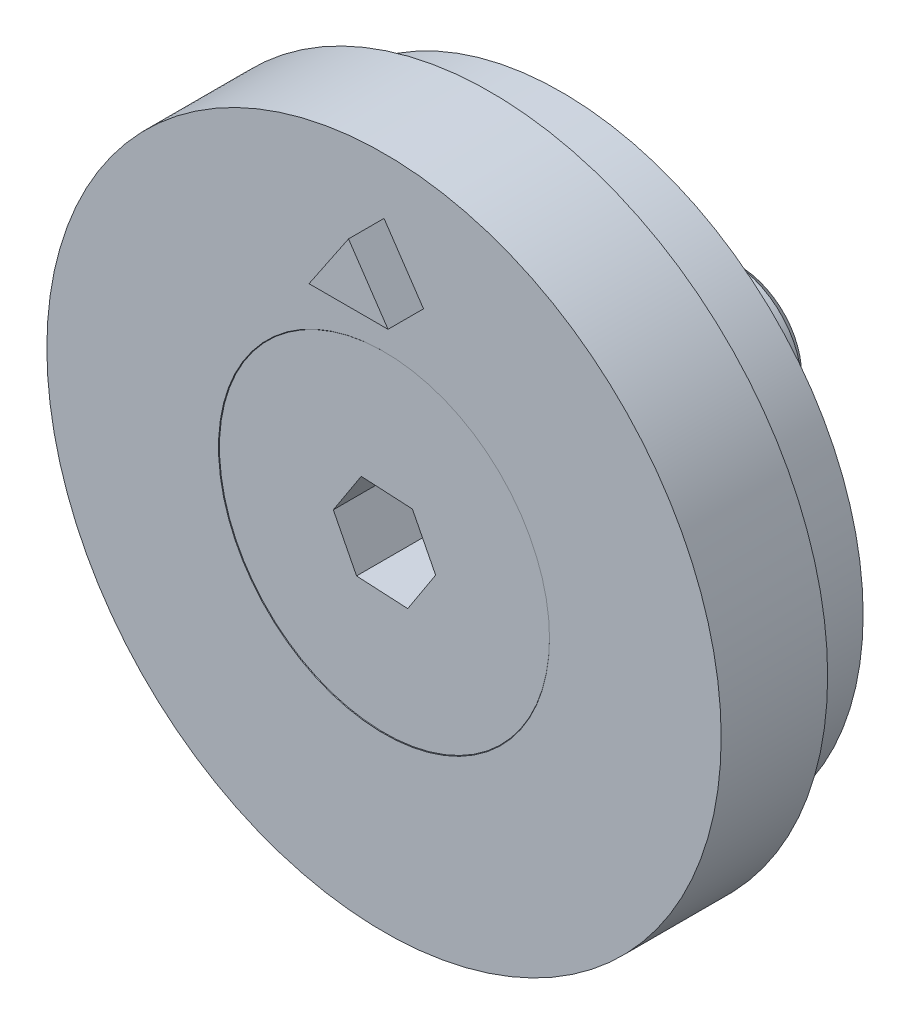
ISO-10303-21;
HEADER;
FILE_DESCRIPTION(('STEP AP214'),'2;1');
FILE_NAME('part.step','',(''),(''),'','','');
FILE_SCHEMA(('AUTOMOTIVE_DESIGN { 1 0 10303 214 1 1 1 1 }'));
ENDSEC;
DATA;
#1=APPLICATION_CONTEXT('core data for automotive mechanical design processes');
#2=APPLICATION_PROTOCOL_DEFINITION('international standard','automotive_design',2000,#1);
#3=PRODUCT_CONTEXT('',#1,'mechanical');
#4=PRODUCT('Part','Part','',(#3));
#5=PRODUCT_RELATED_PRODUCT_CATEGORY('part','',(#4));
#6=PRODUCT_DEFINITION_FORMATION('','',#4);
#7=PRODUCT_DEFINITION_CONTEXT('part definition',#1,'design');
#8=PRODUCT_DEFINITION('design','',#6,#7);
#9=PRODUCT_DEFINITION_SHAPE('','',#8);
#10=(LENGTH_UNIT() NAMED_UNIT(*) SI_UNIT(.MILLI.,.METRE.));
#11=(NAMED_UNIT(*) PLANE_ANGLE_UNIT() SI_UNIT($,.RADIAN.));
#12=(NAMED_UNIT(*) SI_UNIT($,.STERADIAN.) SOLID_ANGLE_UNIT());
#13=UNCERTAINTY_MEASURE_WITH_UNIT(LENGTH_MEASURE(1.E-05),#10,'distance_accuracy_value','');
#14=(GEOMETRIC_REPRESENTATION_CONTEXT(3) GLOBAL_UNCERTAINTY_ASSIGNED_CONTEXT((#13)) GLOBAL_UNIT_ASSIGNED_CONTEXT((#10,
#11,#12)) REPRESENTATION_CONTEXT('',''));
#15=CARTESIAN_POINT('',(0.,0.,0.));
#16=DIRECTION('',(0.,0.,1.));
#17=DIRECTION('',(1.,0.,0.));
#18=AXIS2_PLACEMENT_3D('',#15,#16,#17);
#19=CARTESIAN_POINT('',(0.,0.,-0.013));
#20=DIRECTION('',(0.,0.,1.));
#21=DIRECTION('',(1.,0.,0.));
#22=AXIS2_PLACEMENT_3D('',#19,#20,#21);
#23=CYLINDRICAL_SURFACE('',#22,2.);
#24=CARTESIAN_POINT('',(0.,0.,-2.663));
#25=DIRECTION('',(0.,0.,1.));
#26=DIRECTION('',(1.,0.,0.));
#27=AXIS2_PLACEMENT_3D('',#24,#25,#26);
#28=CIRCLE('',#27,2.);
#29=CARTESIAN_POINT('',(2.,0.,-2.663));
#30=VERTEX_POINT('',#29);
#31=EDGE_CURVE('P0_E11',#30,#30,#28,.T.);
#32=ORIENTED_EDGE('',*,*,#31,.F.);
#33=EDGE_LOOP('',(#32));
#34=FACE_BOUND('',#33,.T.);
#35=CARTESIAN_POINT('',(0.,0.,-9.763));
#36=DIRECTION('',(0.,0.,1.));
#37=DIRECTION('',(1.,0.,0.));
#38=AXIS2_PLACEMENT_3D('',#35,#36,#37);
#39=CIRCLE('',#38,2.);
#40=CARTESIAN_POINT('',(2.,0.,-9.763));
#41=VERTEX_POINT('',#40);
#42=EDGE_CURVE('P0_E136',#41,#41,#39,.T.);
#43=ORIENTED_EDGE('',*,*,#42,.T.);
#44=EDGE_LOOP('',(#43));
#45=FACE_BOUND('',#44,.T.);
#46=ADVANCED_FACE('P0_F35',(#34,#45),#23,.T.);
#47=CARTESIAN_POINT('',(0.,0.,-2.663));
#48=DIRECTION('',(0.,0.,1.));
#49=DIRECTION('',(1.,0.,0.));
#50=AXIS2_PLACEMENT_3D('',#47,#48,#49);
#51=CONICAL_SURFACE('',#50,2.,0.785398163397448);
#52=CARTESIAN_POINT('',(0.,0.,-0.013));
#53=DIRECTION('',(0.,0.,1.));
#54=DIRECTION('',(1.,0.,0.));
#55=AXIS2_PLACEMENT_3D('',#52,#53,#54);
#56=CIRCLE('',#55,4.65);
#57=CARTESIAN_POINT('',(4.65,0.,-0.013));
#58=VERTEX_POINT('',#57);
#59=EDGE_CURVE('P0_E42',#58,#58,#56,.T.);
#60=ORIENTED_EDGE('',*,*,#59,.F.);
#61=EDGE_LOOP('',(#60));
#62=FACE_BOUND('',#61,.T.);
#63=ORIENTED_EDGE('',*,*,#31,.T.);
#64=EDGE_LOOP('',(#63));
#65=FACE_BOUND('',#64,.T.);
#66=ADVANCED_FACE('P0_F151',(#62,#65),#51,.T.);
#67=CARTESIAN_POINT('',(0.,4.65,-0.013));
#68=DIRECTION('',(0.,0.,-1.));
#69=DIRECTION('',(-1.,0.,0.));
#70=AXIS2_PLACEMENT_3D('',#67,#68,#69);
#71=PLANE('',#70);
#72=DIRECTION('',(0.99860351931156,-0.0528300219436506,0.));
#73=VECTOR('',#72,1.);
#74=CARTESIAN_POINT('',(-0.786717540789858,-1.21012761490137,-0.013));
#75=LINE('',#74,#73);
#76=CARTESIAN_POINT('',(-0.786717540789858,-1.21012761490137,-0.013));
#77=VERTEX_POINT('',#76);
#78=CARTESIAN_POINT('',(0.654642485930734,-1.28638118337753,-0.013));
#79=VERTEX_POINT('',#78);
#80=EDGE_CURVE('P0_E123',#77,#79,#75,.T.);
#81=ORIENTED_EDGE('',*,*,#80,.F.);
#82=DIRECTION('',(0.453549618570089,-0.891231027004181,0.));
#83=VECTOR('',#82,1.);
#84=CARTESIAN_POINT('',(-1.44136002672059,0.0762535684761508,-0.013));
#85=LINE('',#84,#83);
#86=CARTESIAN_POINT('',(-1.44136002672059,0.0762535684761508,-0.013));
#87=VERTEX_POINT('',#86);
#88=EDGE_CURVE('P0_E49',#87,#77,#85,.T.);
#89=ORIENTED_EDGE('',*,*,#88,.F.);
#90=DIRECTION('',(-0.545053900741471,-0.83840100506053,0.));
#91=VECTOR('',#90,1.);
#92=CARTESIAN_POINT('',(-0.654642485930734,1.28638118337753,-0.013));
#93=LINE('',#92,#91);
#94=CARTESIAN_POINT('',(-0.654642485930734,1.28638118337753,-0.013));
#95=VERTEX_POINT('',#94);
#96=EDGE_CURVE('P0_E132',#95,#87,#93,.T.);
#97=ORIENTED_EDGE('',*,*,#96,.F.);
#98=DIRECTION('',(-0.99860351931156,0.0528300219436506,0.));
#99=VECTOR('',#98,1.);
#100=CARTESIAN_POINT('',(0.786717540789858,1.21012761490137,-0.013));
#101=LINE('',#100,#99);
#102=CARTESIAN_POINT('',(0.786717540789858,1.21012761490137,-0.013));
#103=VERTEX_POINT('',#102);
#104=EDGE_CURVE('P0_E130',#103,#95,#101,.T.);
#105=ORIENTED_EDGE('',*,*,#104,.F.);
#106=DIRECTION('',(-0.45354961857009,0.891231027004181,0.));
#107=VECTOR('',#106,1.);
#108=CARTESIAN_POINT('',(1.44136002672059,-0.0762535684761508,-0.013));
#109=LINE('',#108,#107);
#110=CARTESIAN_POINT('',(1.44136002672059,-0.0762535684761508,-0.013));
#111=VERTEX_POINT('',#110);
#112=EDGE_CURVE('P0_E97',#111,#103,#109,.T.);
#113=ORIENTED_EDGE('',*,*,#112,.F.);
#114=DIRECTION('',(0.545053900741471,0.83840100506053,0.));
#115=VECTOR('',#114,1.);
#116=CARTESIAN_POINT('',(0.654642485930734,-1.28638118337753,-0.013));
#117=LINE('',#116,#115);
#118=EDGE_CURVE('P0_E126',#79,#111,#117,.T.);
#119=ORIENTED_EDGE('',*,*,#118,.F.);
#120=EDGE_LOOP('',(#81,#89,#97,#105,#113,#119));
#121=FACE_BOUND('',#120,.T.);
#122=ORIENTED_EDGE('',*,*,#59,.T.);
#123=EDGE_LOOP('',(#122));
#124=FACE_BOUND('',#123,.T.);
#125=ADVANCED_FACE('P0_F149',(#121,#124),#71,.F.);
#126=CARTESIAN_POINT('',(0.,0.,-10.013));
#127=DIRECTION('',(0.,0.,1.));
#128=DIRECTION('',(1.,0.,0.));
#129=AXIS2_PLACEMENT_3D('',#126,#127,#128);
#130=PLANE('',#129);
#131=CARTESIAN_POINT('',(0.,0.,-10.013));
#132=DIRECTION('',(0.,0.,1.));
#133=DIRECTION('',(1.,0.,0.));
#134=AXIS2_PLACEMENT_3D('',#131,#132,#133);
#135=CIRCLE('',#134,1.75);
#136=CARTESIAN_POINT('',(1.75,0.,-10.013));
#137=VERTEX_POINT('',#136);
#138=EDGE_CURVE('P0_E144',#137,#137,#135,.T.);
#139=ORIENTED_EDGE('',*,*,#138,.F.);
#140=EDGE_LOOP('',(#139));
#141=FACE_BOUND('',#140,.T.);
#142=ADVANCED_FACE('P0_F164',(#141),#130,.F.);
#143=CARTESIAN_POINT('',(0.,0.,-10.013));
#144=DIRECTION('',(0.,0.,1.));
#145=DIRECTION('',(1.,0.,0.));
#146=AXIS2_PLACEMENT_3D('',#143,#144,#145);
#147=CONICAL_SURFACE('',#146,1.75,0.78539816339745);
#148=ORIENTED_EDGE('',*,*,#42,.F.);
#149=EDGE_LOOP('',(#148));
#150=FACE_BOUND('',#149,.T.);
#151=ORIENTED_EDGE('',*,*,#138,.T.);
#152=EDGE_LOOP('',(#151));
#153=FACE_BOUND('',#152,.T.);
#154=ADVANCED_FACE('P0_F160',(#150,#153),#147,.T.);
#155=CARTESIAN_POINT('',(-1.44136002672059,0.0762535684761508,-2.013));
#156=DIRECTION('',(-0.891231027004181,-0.453549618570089,0.));
#157=DIRECTION('',(0.453549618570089,-0.891231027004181,0.));
#158=AXIS2_PLACEMENT_3D('',#155,#156,#157);
#159=PLANE('',#158);
#160=ORIENTED_EDGE('',*,*,#88,.T.);
#161=DIRECTION('',(0.,0.,1.));
#162=VECTOR('',#161,1.);
#163=CARTESIAN_POINT('',(-0.786717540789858,-1.21012761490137,-2.013));
#164=LINE('',#163,#162);
#165=CARTESIAN_POINT('',(-0.786717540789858,-1.21012761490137,-2.013));
#166=VERTEX_POINT('',#165);
#167=EDGE_CURVE('P0_E79',#166,#77,#164,.T.);
#168=ORIENTED_EDGE('',*,*,#167,.F.);
#169=DIRECTION('',(0.453549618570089,-0.891231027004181,0.));
#170=VECTOR('',#169,1.);
#171=CARTESIAN_POINT('',(-1.44136002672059,0.0762535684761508,-2.013));
#172=LINE('',#171,#170);
#173=CARTESIAN_POINT('',(-1.44136002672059,0.0762535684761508,-2.013));
#174=VERTEX_POINT('',#173);
#175=EDGE_CURVE('P0_E134',#174,#166,#172,.T.);
#176=ORIENTED_EDGE('',*,*,#175,.F.);
#177=DIRECTION('',(0.,0.,1.));
#178=VECTOR('',#177,1.);
#179=CARTESIAN_POINT('',(-1.44136002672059,0.0762535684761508,-2.013));
#180=LINE('',#179,#178);
#181=EDGE_CURVE('P0_E57',#174,#87,#180,.T.);
#182=ORIENTED_EDGE('',*,*,#181,.T.);
#183=EDGE_LOOP('',(#160,#168,#176,#182));
#184=FACE_BOUND('',#183,.T.);
#185=ADVANCED_FACE('P0_F163',(#184),#159,.F.);
#186=CARTESIAN_POINT('',(-0.654642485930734,1.28638118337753,-2.013));
#187=DIRECTION('',(-0.83840100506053,0.545053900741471,0.));
#188=DIRECTION('',(-0.54505390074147,-0.83840100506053,0.));
#189=AXIS2_PLACEMENT_3D('',#186,#187,#188);
#190=PLANE('',#189);
#191=ORIENTED_EDGE('',*,*,#96,.T.);
#192=ORIENTED_EDGE('',*,*,#181,.F.);
#193=DIRECTION('',(-0.545053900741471,-0.83840100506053,0.));
#194=VECTOR('',#193,1.);
#195=CARTESIAN_POINT('',(-0.654642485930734,1.28638118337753,-2.013));
#196=LINE('',#195,#194);
#197=CARTESIAN_POINT('',(-0.654642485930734,1.28638118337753,-2.013));
#198=VERTEX_POINT('',#197);
#199=EDGE_CURVE('P0_E109',#198,#174,#196,.T.);
#200=ORIENTED_EDGE('',*,*,#199,.F.);
#201=DIRECTION('',(0.,0.,1.));
#202=VECTOR('',#201,1.);
#203=CARTESIAN_POINT('',(-0.654642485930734,1.28638118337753,-2.013));
#204=LINE('',#203,#202);
#205=EDGE_CURVE('P0_E101',#198,#95,#204,.T.);
#206=ORIENTED_EDGE('',*,*,#205,.T.);
#207=EDGE_LOOP('',(#191,#192,#200,#206));
#208=FACE_BOUND('',#207,.T.);
#209=ADVANCED_FACE('P0_F178',(#208),#190,.F.);
#210=CARTESIAN_POINT('',(0.786717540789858,1.21012761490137,-2.013));
#211=DIRECTION('',(0.0528300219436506,0.99860351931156,0.));
#212=DIRECTION('',(-0.99860351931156,0.0528300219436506,0.));
#213=AXIS2_PLACEMENT_3D('',#210,#211,#212);
#214=PLANE('',#213);
#215=ORIENTED_EDGE('',*,*,#104,.T.);
#216=ORIENTED_EDGE('',*,*,#205,.F.);
#217=DIRECTION('',(-0.99860351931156,0.0528300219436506,0.));
#218=VECTOR('',#217,1.);
#219=CARTESIAN_POINT('',(0.786717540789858,1.21012761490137,-2.013));
#220=LINE('',#219,#218);
#221=CARTESIAN_POINT('',(0.786717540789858,1.21012761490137,-2.013));
#222=VERTEX_POINT('',#221);
#223=EDGE_CURVE('P0_E105',#222,#198,#220,.T.);
#224=ORIENTED_EDGE('',*,*,#223,.F.);
#225=DIRECTION('',(0.,0.,1.));
#226=VECTOR('',#225,1.);
#227=CARTESIAN_POINT('',(0.786717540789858,1.21012761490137,-2.013));
#228=LINE('',#227,#226);
#229=EDGE_CURVE('P0_E90',#222,#103,#228,.T.);
#230=ORIENTED_EDGE('',*,*,#229,.T.);
#231=EDGE_LOOP('',(#215,#216,#224,#230));
#232=FACE_BOUND('',#231,.T.);
#233=ADVANCED_FACE('P0_F106',(#232),#214,.F.);
#234=CARTESIAN_POINT('',(1.44136002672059,-0.0762535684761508,-2.013));
#235=DIRECTION('',(0.89123102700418,0.45354961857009,0.));
#236=DIRECTION('',(-0.45354961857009,0.891231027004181,0.));
#237=AXIS2_PLACEMENT_3D('',#234,#235,#236);
#238=PLANE('',#237);
#239=ORIENTED_EDGE('',*,*,#112,.T.);
#240=ORIENTED_EDGE('',*,*,#229,.F.);
#241=DIRECTION('',(-0.45354961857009,0.891231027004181,0.));
#242=VECTOR('',#241,1.);
#243=CARTESIAN_POINT('',(1.44136002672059,-0.0762535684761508,-2.013));
#244=LINE('',#243,#242);
#245=CARTESIAN_POINT('',(1.44136002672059,-0.0762535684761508,-2.013));
#246=VERTEX_POINT('',#245);
#247=EDGE_CURVE('P0_E94',#246,#222,#244,.T.);
#248=ORIENTED_EDGE('',*,*,#247,.F.);
#249=DIRECTION('',(0.,0.,1.));
#250=VECTOR('',#249,1.);
#251=CARTESIAN_POINT('',(1.44136002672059,-0.0762535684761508,-2.013));
#252=LINE('',#251,#250);
#253=EDGE_CURVE('P0_E102',#246,#111,#252,.T.);
#254=ORIENTED_EDGE('',*,*,#253,.T.);
#255=EDGE_LOOP('',(#239,#240,#248,#254));
#256=FACE_BOUND('',#255,.T.);
#257=ADVANCED_FACE('P0_F92',(#256),#238,.F.);
#258=CARTESIAN_POINT('',(0.654642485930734,-1.28638118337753,-2.013));
#259=DIRECTION('',(0.83840100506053,-0.545053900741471,0.));
#260=DIRECTION('',(0.54505390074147,0.83840100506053,0.));
#261=AXIS2_PLACEMENT_3D('',#258,#259,#260);
#262=PLANE('',#261);
#263=ORIENTED_EDGE('',*,*,#118,.T.);
#264=ORIENTED_EDGE('',*,*,#253,.F.);
#265=DIRECTION('',(0.545053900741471,0.83840100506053,0.));
#266=VECTOR('',#265,1.);
#267=CARTESIAN_POINT('',(0.654642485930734,-1.28638118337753,-2.013));
#268=LINE('',#267,#266);
#269=CARTESIAN_POINT('',(0.654642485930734,-1.28638118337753,-2.013));
#270=VERTEX_POINT('',#269);
#271=EDGE_CURVE('P0_E115',#270,#246,#268,.T.);
#272=ORIENTED_EDGE('',*,*,#271,.F.);
#273=DIRECTION('',(0.,0.,1.));
#274=VECTOR('',#273,1.);
#275=CARTESIAN_POINT('',(0.654642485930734,-1.28638118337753,-2.013));
#276=LINE('',#275,#274);
#277=EDGE_CURVE('P0_E139',#270,#79,#276,.T.);
#278=ORIENTED_EDGE('',*,*,#277,.T.);
#279=EDGE_LOOP('',(#263,#264,#272,#278));
#280=FACE_BOUND('',#279,.T.);
#281=ADVANCED_FACE('P0_F182',(#280),#262,.F.);
#282=CARTESIAN_POINT('',(-0.786717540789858,-1.21012761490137,-2.013));
#283=DIRECTION('',(-0.0528300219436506,-0.99860351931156,0.));
#284=DIRECTION('',(0.99860351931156,-0.0528300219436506,0.));
#285=AXIS2_PLACEMENT_3D('',#282,#283,#284);
#286=PLANE('',#285);
#287=ORIENTED_EDGE('',*,*,#80,.T.);
#288=ORIENTED_EDGE('',*,*,#277,.F.);
#289=DIRECTION('',(0.99860351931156,-0.0528300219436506,0.));
#290=VECTOR('',#289,1.);
#291=CARTESIAN_POINT('',(-0.786717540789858,-1.21012761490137,-2.013));
#292=LINE('',#291,#290);
#293=EDGE_CURVE('P0_E117',#166,#270,#292,.T.);
#294=ORIENTED_EDGE('',*,*,#293,.F.);
#295=ORIENTED_EDGE('',*,*,#167,.T.);
#296=EDGE_LOOP('',(#287,#288,#294,#295));
#297=FACE_BOUND('',#296,.T.);
#298=ADVANCED_FACE('P0_F179',(#297),#286,.F.);
#299=CARTESIAN_POINT('',(0.,0.,-2.013));
#300=DIRECTION('',(0.,0.,1.));
#301=DIRECTION('',(1.,0.,0.));
#302=AXIS2_PLACEMENT_3D('',#299,#300,#301);
#303=PLANE('',#302);
#304=ORIENTED_EDGE('',*,*,#175,.T.);
#305=ORIENTED_EDGE('',*,*,#293,.T.);
#306=ORIENTED_EDGE('',*,*,#271,.T.);
#307=ORIENTED_EDGE('',*,*,#247,.T.);
#308=ORIENTED_EDGE('',*,*,#223,.T.);
#309=ORIENTED_EDGE('',*,*,#199,.T.);
#310=EDGE_LOOP('',(#304,#305,#306,#307,#308,#309));
#311=FACE_BOUND('',#310,.T.);
#312=ADVANCED_FACE('P0_F112',(#311),#303,.T.);
#313=CLOSED_SHELL('',(#46,#66,#125,#142,#154,#185,#209,#233,#257,#281,#298,#312));
#314=MANIFOLD_SOLID_BREP('P0_B2',#313);
#315=CARTESIAN_POINT('',(0.,9.5,0.));
#316=DIRECTION('',(0.,0.,-1.));
#317=DIRECTION('',(-1.,0.,0.));
#318=AXIS2_PLACEMENT_3D('',#315,#316,#317);
#319=PLANE('',#318);
#320=CARTESIAN_POINT('',(0.,0.,0.));
#321=DIRECTION('',(0.,0.,1.));
#322=DIRECTION('',(1.,0.,0.));
#323=AXIS2_PLACEMENT_3D('',#320,#321,#322);
#324=CIRCLE('',#323,9.5);
#325=CARTESIAN_POINT('',(9.5,0.,0.));
#326=VERTEX_POINT('',#325);
#327=EDGE_CURVE('P1_E11',#326,#326,#324,.T.);
#328=ORIENTED_EDGE('',*,*,#327,.T.);
#329=EDGE_LOOP('',(#328));
#330=FACE_BOUND('',#329,.T.);
#331=CARTESIAN_POINT('',(0.,0.,0.));
#332=DIRECTION('',(0.,0.,1.));
#333=DIRECTION('',(1.,0.,0.));
#334=AXIS2_PLACEMENT_3D('',#331,#332,#333);
#335=CIRCLE('',#334,4.663);
#336=CARTESIAN_POINT('',(4.663,0.,0.));
#337=VERTEX_POINT('',#336);
#338=EDGE_CURVE('P1_E24',#337,#337,#335,.T.);
#339=ORIENTED_EDGE('',*,*,#338,.F.);
#340=EDGE_LOOP('',(#339));
#341=FACE_BOUND('',#340,.T.);
#342=DIRECTION('',(1.,0.,0.));
#343=VECTOR('',#342,1.);
#344=CARTESIAN_POINT('',(-1.11293905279,6.264516,0.));
#345=LINE('',#344,#343);
#346=CARTESIAN_POINT('',(-1.11293905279,6.264516,0.));
#347=VERTEX_POINT('',#346);
#348=CARTESIAN_POINT('',(1.11293905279,6.264516,0.));
#349=VERTEX_POINT('',#348);
#350=EDGE_CURVE('P1_E68',#347,#349,#345,.T.);
#351=ORIENTED_EDGE('',*,*,#350,.F.);
#352=DIRECTION('',(-0.559192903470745,-0.829037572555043,0.));
#353=VECTOR('',#352,1.);
#354=CARTESIAN_POINT('',(0.,7.914516,0.));
#355=LINE('',#354,#353);
#356=CARTESIAN_POINT('',(0.,7.914516,0.));
#357=VERTEX_POINT('',#356);
#358=EDGE_CURVE('P1_E35',#357,#347,#355,.T.);
#359=ORIENTED_EDGE('',*,*,#358,.F.);
#360=DIRECTION('',(-0.559192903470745,0.829037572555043,0.));
#361=VECTOR('',#360,1.);
#362=CARTESIAN_POINT('',(1.11293905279,6.264516,0.));
#363=LINE('',#362,#361);
#364=EDGE_CURVE('P1_E31',#349,#357,#363,.T.);
#365=ORIENTED_EDGE('',*,*,#364,.F.);
#366=EDGE_LOOP('',(#351,#359,#365));
#367=FACE_BOUND('',#366,.T.);
#368=ADVANCED_FACE('P1_F16',(#330,#341,#367),#319,.F.);
#369=CARTESIAN_POINT('',(0.,0.,3.12219627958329));
#370=DIRECTION('',(0.,0.,1.));
#371=DIRECTION('',(1.,0.,0.));
#372=AXIS2_PLACEMENT_3D('',#369,#370,#371);
#373=CYLINDRICAL_SURFACE('',#372,9.5);
#374=ORIENTED_EDGE('',*,*,#327,.F.);
#375=EDGE_LOOP('',(#374));
#376=FACE_BOUND('',#375,.T.);
#377=CARTESIAN_POINT('',(0.,0.,-3.));
#378=DIRECTION('',(0.,0.,1.));
#379=DIRECTION('',(1.,0.,0.));
#380=AXIS2_PLACEMENT_3D('',#377,#378,#379);
#381=CIRCLE('',#380,9.5);
#382=CARTESIAN_POINT('',(9.5,0.,-3.));
#383=VERTEX_POINT('',#382);
#384=EDGE_CURVE('P1_E69',#383,#383,#381,.T.);
#385=ORIENTED_EDGE('',*,*,#384,.T.);
#386=EDGE_LOOP('',(#385));
#387=FACE_BOUND('',#386,.T.);
#388=ADVANCED_FACE('P1_F18',(#376,#387),#373,.T.);
#389=CARTESIAN_POINT('',(0.,0.,0.));
#390=DIRECTION('',(0.,0.,1.));
#391=DIRECTION('',(1.,0.,0.));
#392=AXIS2_PLACEMENT_3D('',#389,#390,#391);
#393=CONICAL_SURFACE('',#392,4.663,0.785398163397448);
#394=CARTESIAN_POINT('',(0.,0.,-2.663));
#395=DIRECTION('',(0.,0.,1.));
#396=DIRECTION('',(1.,0.,0.));
#397=AXIS2_PLACEMENT_3D('',#394,#395,#396);
#398=CIRCLE('',#397,2.);
#399=CARTESIAN_POINT('',(2.,0.,-2.663));
#400=VERTEX_POINT('',#399);
#401=EDGE_CURVE('P1_E86',#400,#400,#398,.T.);
#402=ORIENTED_EDGE('',*,*,#401,.F.);
#403=EDGE_LOOP('',(#402));
#404=FACE_BOUND('',#403,.T.);
#405=ORIENTED_EDGE('',*,*,#338,.T.);
#406=EDGE_LOOP('',(#405));
#407=FACE_BOUND('',#406,.T.);
#408=ADVANCED_FACE('P1_F91',(#404,#407),#393,.F.);
#409=CARTESIAN_POINT('',(0.,0.,3.12219627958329));
#410=DIRECTION('',(0.,0.,1.));
#411=DIRECTION('',(1.,0.,0.));
#412=AXIS2_PLACEMENT_3D('',#409,#410,#411);
#413=CYLINDRICAL_SURFACE('',#412,2.);
#414=CARTESIAN_POINT('',(0.,0.,-5.));
#415=DIRECTION('',(0.,0.,1.));
#416=DIRECTION('',(1.,0.,0.));
#417=AXIS2_PLACEMENT_3D('',#414,#415,#416);
#418=CIRCLE('',#417,2.);
#419=CARTESIAN_POINT('',(2.,0.,-5.));
#420=VERTEX_POINT('',#419);
#421=EDGE_CURVE('P1_E83',#420,#420,#418,.T.);
#422=ORIENTED_EDGE('',*,*,#421,.F.);
#423=EDGE_LOOP('',(#422));
#424=FACE_BOUND('',#423,.T.);
#425=ORIENTED_EDGE('',*,*,#401,.T.);
#426=EDGE_LOOP('',(#425));
#427=FACE_BOUND('',#426,.T.);
#428=ADVANCED_FACE('P1_F124',(#424,#427),#413,.F.);
#429=CARTESIAN_POINT('',(0.,2.,-5.));
#430=DIRECTION('',(0.,0.,1.));
#431=DIRECTION('',(1.,0.,0.));
#432=AXIS2_PLACEMENT_3D('',#429,#430,#431);
#433=PLANE('',#432);
#434=CARTESIAN_POINT('',(0.,0.,-5.));
#435=DIRECTION('',(0.,0.,1.));
#436=DIRECTION('',(1.,0.,0.));
#437=AXIS2_PLACEMENT_3D('',#434,#435,#436);
#438=CIRCLE('',#437,8.5);
#439=CARTESIAN_POINT('',(8.5,0.,-5.));
#440=VERTEX_POINT('',#439);
#441=EDGE_CURVE('P1_E80',#440,#440,#438,.T.);
#442=ORIENTED_EDGE('',*,*,#441,.F.);
#443=EDGE_LOOP('',(#442));
#444=FACE_BOUND('',#443,.T.);
#445=ORIENTED_EDGE('',*,*,#421,.T.);
#446=EDGE_LOOP('',(#445));
#447=FACE_BOUND('',#446,.T.);
#448=ADVANCED_FACE('P1_F120',(#444,#447),#433,.F.);
#449=CARTESIAN_POINT('',(0.,0.,3.12219627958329));
#450=DIRECTION('',(0.,0.,1.));
#451=DIRECTION('',(1.,0.,0.));
#452=AXIS2_PLACEMENT_3D('',#449,#450,#451);
#453=CYLINDRICAL_SURFACE('',#452,8.5);
#454=CARTESIAN_POINT('',(0.,0.,-3.));
#455=DIRECTION('',(0.,0.,1.));
#456=DIRECTION('',(1.,0.,0.));
#457=AXIS2_PLACEMENT_3D('',#454,#455,#456);
#458=CIRCLE('',#457,8.5);
#459=CARTESIAN_POINT('',(8.5,0.,-3.));
#460=VERTEX_POINT('',#459);
#461=EDGE_CURVE('P1_E72',#460,#460,#458,.T.);
#462=ORIENTED_EDGE('',*,*,#461,.F.);
#463=EDGE_LOOP('',(#462));
#464=FACE_BOUND('',#463,.T.);
#465=ORIENTED_EDGE('',*,*,#441,.T.);
#466=EDGE_LOOP('',(#465));
#467=FACE_BOUND('',#466,.T.);
#468=ADVANCED_FACE('P1_F116',(#464,#467),#453,.T.);
#469=CARTESIAN_POINT('',(0.,8.5,-3.));
#470=DIRECTION('',(0.,0.,1.));
#471=DIRECTION('',(1.,0.,0.));
#472=AXIS2_PLACEMENT_3D('',#469,#470,#471);
#473=PLANE('',#472);
#474=ORIENTED_EDGE('',*,*,#384,.F.);
#475=EDGE_LOOP('',(#474));
#476=FACE_BOUND('',#475,.T.);
#477=ORIENTED_EDGE('',*,*,#461,.T.);
#478=EDGE_LOOP('',(#477));
#479=FACE_BOUND('',#478,.T.);
#480=ADVANCED_FACE('P1_F113',(#476,#479),#473,.F.);
#481=CARTESIAN_POINT('',(-1.11293905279,6.264516,1.));
#482=DIRECTION('',(0.,1.,0.));
#483=DIRECTION('',(0.,0.,1.));
#484=AXIS2_PLACEMENT_3D('',#481,#482,#483);
#485=PLANE('',#484);
#486=ORIENTED_EDGE('',*,*,#350,.T.);
#487=DIRECTION('',(0.,0.,-1.));
#488=VECTOR('',#487,1.);
#489=CARTESIAN_POINT('',(1.11293905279,6.264516,1.));
#490=LINE('',#489,#488);
#491=CARTESIAN_POINT('',(1.11293905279,6.264516,1.));
#492=VERTEX_POINT('',#491);
#493=EDGE_CURVE('P1_E52',#492,#349,#490,.T.);
#494=ORIENTED_EDGE('',*,*,#493,.F.);
#495=DIRECTION('',(1.,0.,0.));
#496=VECTOR('',#495,1.);
#497=CARTESIAN_POINT('',(-1.11293905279,6.264516,1.));
#498=LINE('',#497,#496);
#499=CARTESIAN_POINT('',(-1.11293905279,6.264516,1.));
#500=VERTEX_POINT('',#499);
#501=EDGE_CURVE('P1_E59',#500,#492,#498,.T.);
#502=ORIENTED_EDGE('',*,*,#501,.F.);
#503=DIRECTION('',(0.,0.,-1.));
#504=VECTOR('',#503,1.);
#505=CARTESIAN_POINT('',(-1.11293905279,6.264516,1.));
#506=LINE('',#505,#504);
#507=EDGE_CURVE('P1_E74',#500,#347,#506,.T.);
#508=ORIENTED_EDGE('',*,*,#507,.T.);
#509=EDGE_LOOP('',(#486,#494,#502,#508));
#510=FACE_BOUND('',#509,.T.);
#511=ADVANCED_FACE('P1_F67',(#510),#485,.F.);
#512=CARTESIAN_POINT('',(1.11293905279,6.264516,1.));
#513=DIRECTION('',(-0.829037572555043,-0.559192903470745,0.));
#514=DIRECTION('',(0.559192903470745,-0.829037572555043,0.));
#515=AXIS2_PLACEMENT_3D('',#512,#513,#514);
#516=PLANE('',#515);
#517=ORIENTED_EDGE('',*,*,#364,.T.);
#518=DIRECTION('',(0.,0.,-1.));
#519=VECTOR('',#518,1.);
#520=CARTESIAN_POINT('',(0.,7.914516,1.));
#521=LINE('',#520,#519);
#522=CARTESIAN_POINT('',(0.,7.914516,1.));
#523=VERTEX_POINT('',#522);
#524=EDGE_CURVE('P1_E55',#523,#357,#521,.T.);
#525=ORIENTED_EDGE('',*,*,#524,.F.);
#526=DIRECTION('',(-0.559192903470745,0.829037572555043,0.));
#527=VECTOR('',#526,1.);
#528=CARTESIAN_POINT('',(1.11293905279,6.264516,1.));
#529=LINE('',#528,#527);
#530=EDGE_CURVE('P1_E48',#492,#523,#529,.T.);
#531=ORIENTED_EDGE('',*,*,#530,.F.);
#532=ORIENTED_EDGE('',*,*,#493,.T.);
#533=EDGE_LOOP('',(#517,#525,#531,#532));
#534=FACE_BOUND('',#533,.T.);
#535=ADVANCED_FACE('P1_F50',(#534),#516,.F.);
#536=CARTESIAN_POINT('',(0.,7.914516,1.));
#537=DIRECTION('',(0.829037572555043,-0.559192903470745,0.));
#538=DIRECTION('',(0.559192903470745,0.829037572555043,0.));
#539=AXIS2_PLACEMENT_3D('',#536,#537,#538);
#540=PLANE('',#539);
#541=ORIENTED_EDGE('',*,*,#358,.T.);
#542=ORIENTED_EDGE('',*,*,#507,.F.);
#543=DIRECTION('',(-0.559192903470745,-0.829037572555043,0.));
#544=VECTOR('',#543,1.);
#545=CARTESIAN_POINT('',(0.,7.914516,1.));
#546=LINE('',#545,#544);
#547=EDGE_CURVE('P1_E58',#523,#500,#546,.T.);
#548=ORIENTED_EDGE('',*,*,#547,.F.);
#549=ORIENTED_EDGE('',*,*,#524,.T.);
#550=EDGE_LOOP('',(#541,#542,#548,#549));
#551=FACE_BOUND('',#550,.T.);
#552=ADVANCED_FACE('P1_F97',(#551),#540,.F.);
#553=CARTESIAN_POINT('',(1.11293905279,6.264516,1.));
#554=DIRECTION('',(0.,0.,1.));
#555=DIRECTION('',(1.,0.,0.));
#556=AXIS2_PLACEMENT_3D('',#553,#554,#555);
#557=PLANE('',#556);
#558=ORIENTED_EDGE('',*,*,#501,.T.);
#559=ORIENTED_EDGE('',*,*,#530,.T.);
#560=ORIENTED_EDGE('',*,*,#547,.T.);
#561=EDGE_LOOP('',(#558,#559,#560));
#562=FACE_BOUND('',#561,.T.);
#563=ADVANCED_FACE('P1_F62',(#562),#557,.T.);
#564=CLOSED_SHELL('',(#368,#388,#408,#428,#448,#468,#480,#511,#535,#552,#563));
#565=MANIFOLD_SOLID_BREP('P1_B1',#564);
#566=ADVANCED_BREP_SHAPE_REPRESENTATION('',(#18,#314,#565),#14);
#567=SHAPE_DEFINITION_REPRESENTATION(#9,#566);
ENDSEC;
END-ISO-10303-21;
